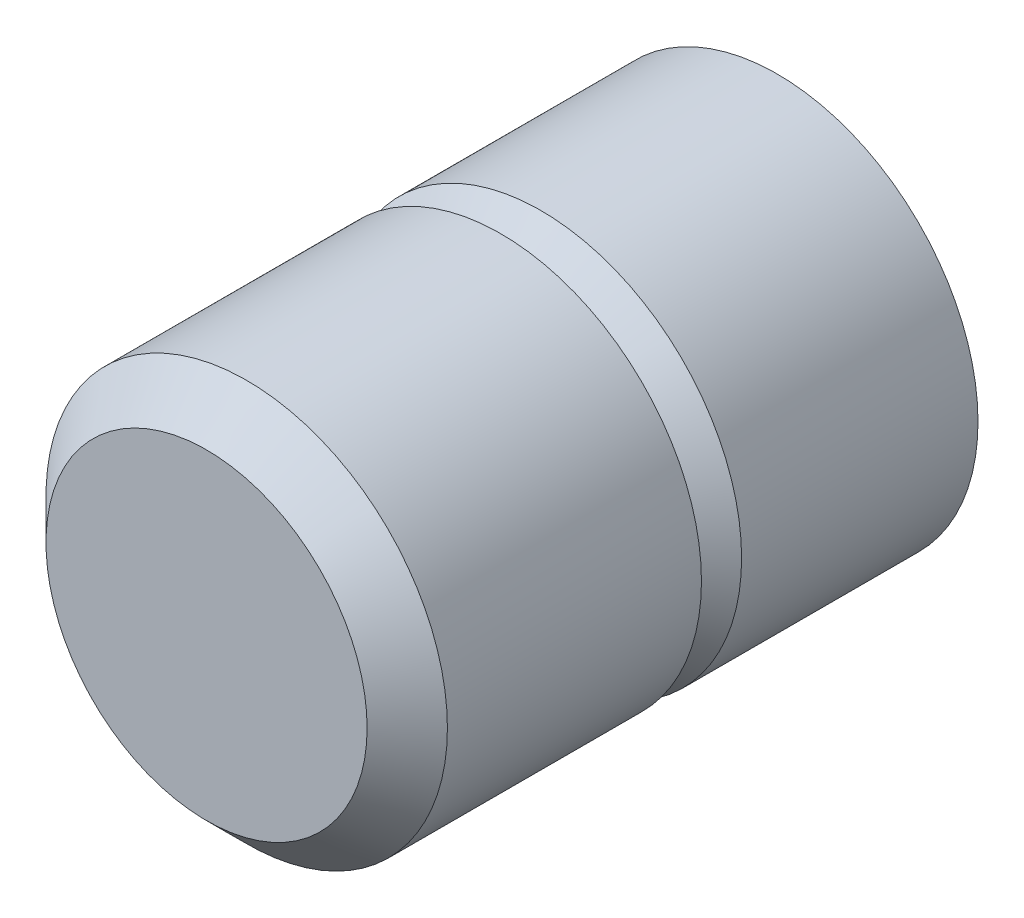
ISO-10303-21;
HEADER;
FILE_DESCRIPTION(('STEP AP214'),'2;1');
FILE_NAME('part.step','',(''),(''),'','','');
FILE_SCHEMA(('AUTOMOTIVE_DESIGN { 1 0 10303 214 1 1 1 1 }'));
ENDSEC;
DATA;
#1=APPLICATION_CONTEXT('core data for automotive mechanical design processes');
#2=APPLICATION_PROTOCOL_DEFINITION('international standard','automotive_design',2000,#1);
#3=PRODUCT_CONTEXT('',#1,'mechanical');
#4=PRODUCT('Part','Part','',(#3));
#5=PRODUCT_RELATED_PRODUCT_CATEGORY('part','',(#4));
#6=PRODUCT_DEFINITION_FORMATION('','',#4);
#7=PRODUCT_DEFINITION_CONTEXT('part definition',#1,'design');
#8=PRODUCT_DEFINITION('design','',#6,#7);
#9=PRODUCT_DEFINITION_SHAPE('','',#8);
#10=(LENGTH_UNIT() NAMED_UNIT(*) SI_UNIT(.MILLI.,.METRE.));
#11=(NAMED_UNIT(*) PLANE_ANGLE_UNIT() SI_UNIT($,.RADIAN.));
#12=(NAMED_UNIT(*) SI_UNIT($,.STERADIAN.) SOLID_ANGLE_UNIT());
#13=UNCERTAINTY_MEASURE_WITH_UNIT(LENGTH_MEASURE(1.E-05),#10,'distance_accuracy_value','');
#14=(GEOMETRIC_REPRESENTATION_CONTEXT(3) GLOBAL_UNCERTAINTY_ASSIGNED_CONTEXT((#13)) GLOBAL_UNIT_ASSIGNED_CONTEXT((#10,
#11,#12)) REPRESENTATION_CONTEXT('',''));
#15=CARTESIAN_POINT('',(0.,0.,0.));
#16=DIRECTION('',(0.,0.,1.));
#17=DIRECTION('',(1.,0.,0.));
#18=AXIS2_PLACEMENT_3D('',#15,#16,#17);
#19=CARTESIAN_POINT('',(0.,0.,0.));
#20=DIRECTION('',(0.,0.,-1.));
#21=DIRECTION('',(-1.,0.,0.));
#22=AXIS2_PLACEMENT_3D('',#19,#20,#21);
#23=PLANE('',#22);
#24=CARTESIAN_POINT('',(0.,0.,0.));
#25=DIRECTION('',(0.,0.,1.));
#26=DIRECTION('',(1.,0.,0.));
#27=AXIS2_PLACEMENT_3D('',#24,#25,#26);
#28=CIRCLE('',#27,6.002528);
#29=CARTESIAN_POINT('',(6.002528,0.,0.));
#30=VERTEX_POINT('',#29);
#31=EDGE_CURVE('E10',#30,#30,#28,.T.);
#32=ORIENTED_EDGE('',*,*,#31,.T.);
#33=EDGE_LOOP('',(#32));
#34=FACE_BOUND('',#33,.T.);
#35=ADVANCED_FACE('F29',(#34),#23,.F.);
#36=CARTESIAN_POINT('',(0.,0.,-1.500632));
#37=DIRECTION('',(0.,0.,-1.));
#38=DIRECTION('',(-1.,0.,0.));
#39=AXIS2_PLACEMENT_3D('',#36,#37,#38);
#40=CONICAL_SURFACE('',#39,7.50316,0.785398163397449);
#41=ORIENTED_EDGE('',*,*,#31,.F.);
#42=EDGE_LOOP('',(#41));
#43=FACE_BOUND('',#42,.T.);
#44=CARTESIAN_POINT('',(0.,0.,-1.500632));
#45=DIRECTION('',(0.,0.,1.));
#46=DIRECTION('',(1.,0.,0.));
#47=AXIS2_PLACEMENT_3D('',#44,#45,#46);
#48=CIRCLE('',#47,7.50316);
#49=CARTESIAN_POINT('',(7.50316,0.,-1.500632));
#50=VERTEX_POINT('',#49);
#51=EDGE_CURVE('E35',#50,#50,#48,.T.);
#52=ORIENTED_EDGE('',*,*,#51,.T.);
#53=EDGE_LOOP('',(#52));
#54=FACE_BOUND('',#53,.T.);
#55=ADVANCED_FACE('F67',(#43,#54),#40,.T.);
#56=CARTESIAN_POINT('',(0.,0.,0.));
#57=DIRECTION('',(0.,0.,1.));
#58=DIRECTION('',(1.,0.,0.));
#59=AXIS2_PLACEMENT_3D('',#56,#57,#58);
#60=CYLINDRICAL_SURFACE('',#59,7.50316);
#61=ORIENTED_EDGE('',*,*,#51,.F.);
#62=EDGE_LOOP('',(#61));
#63=FACE_BOUND('',#62,.T.);
#64=CARTESIAN_POINT('',(0.,0.,-10.9982));
#65=DIRECTION('',(0.,0.,1.));
#66=DIRECTION('',(1.,0.,0.));
#67=AXIS2_PLACEMENT_3D('',#64,#65,#66);
#68=CIRCLE('',#67,7.50316);
#69=CARTESIAN_POINT('',(7.50316,0.,-10.9982));
#70=VERTEX_POINT('',#69);
#71=EDGE_CURVE('E39',#70,#70,#68,.T.);
#72=ORIENTED_EDGE('',*,*,#71,.T.);
#73=EDGE_LOOP('',(#72));
#74=FACE_BOUND('',#73,.T.);
#75=ADVANCED_FACE('F71',(#63,#74),#60,.T.);
#76=CARTESIAN_POINT('',(0.,7.50316,-10.9982));
#77=DIRECTION('',(0.,0.,1.));
#78=DIRECTION('',(1.,0.,0.));
#79=AXIS2_PLACEMENT_3D('',#76,#77,#78);
#80=PLANE('',#79);
#81=ORIENTED_EDGE('',*,*,#71,.F.);
#82=EDGE_LOOP('',(#81));
#83=FACE_BOUND('',#82,.T.);
#84=CARTESIAN_POINT('',(0.,0.,-10.9982));
#85=DIRECTION('',(0.,0.,1.));
#86=DIRECTION('',(1.,0.,0.));
#87=AXIS2_PLACEMENT_3D('',#84,#85,#86);
#88=CIRCLE('',#87,6.002528);
#89=CARTESIAN_POINT('',(6.002528,0.,-10.9982));
#90=VERTEX_POINT('',#89);
#91=EDGE_CURVE('E43',#90,#90,#88,.T.);
#92=ORIENTED_EDGE('',*,*,#91,.T.);
#93=EDGE_LOOP('',(#92));
#94=FACE_BOUND('',#93,.T.);
#95=ADVANCED_FACE('F76',(#83,#94),#80,.F.);
#96=CARTESIAN_POINT('',(0.,0.,-12.498832));
#97=DIRECTION('',(0.,0.,-1.));
#98=DIRECTION('',(-1.,0.,0.));
#99=AXIS2_PLACEMENT_3D('',#96,#97,#98);
#100=CONICAL_SURFACE('',#99,7.50316,0.785398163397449);
#101=ORIENTED_EDGE('',*,*,#91,.F.);
#102=EDGE_LOOP('',(#101));
#103=FACE_BOUND('',#102,.T.);
#104=CARTESIAN_POINT('',(0.,0.,-12.498832));
#105=DIRECTION('',(0.,0.,1.));
#106=DIRECTION('',(1.,0.,0.));
#107=AXIS2_PLACEMENT_3D('',#104,#105,#106);
#108=CIRCLE('',#107,7.50316);
#109=CARTESIAN_POINT('',(7.50316,0.,-12.498832));
#110=VERTEX_POINT('',#109);
#111=EDGE_CURVE('E48',#110,#110,#108,.T.);
#112=ORIENTED_EDGE('',*,*,#111,.T.);
#113=EDGE_LOOP('',(#112));
#114=FACE_BOUND('',#113,.T.);
#115=ADVANCED_FACE('F63',(#103,#114),#100,.T.);
#116=CARTESIAN_POINT('',(0.,0.,0.));
#117=DIRECTION('',(0.,0.,1.));
#118=DIRECTION('',(1.,0.,0.));
#119=AXIS2_PLACEMENT_3D('',#116,#117,#118);
#120=CYLINDRICAL_SURFACE('',#119,7.50316);
#121=ORIENTED_EDGE('',*,*,#111,.F.);
#122=EDGE_LOOP('',(#121));
#123=FACE_BOUND('',#122,.T.);
#124=CARTESIAN_POINT('',(0.,0.,-21.336));
#125=DIRECTION('',(0.,0.,1.));
#126=DIRECTION('',(1.,0.,0.));
#127=AXIS2_PLACEMENT_3D('',#124,#125,#126);
#128=CIRCLE('',#127,7.50316);
#129=CARTESIAN_POINT('',(7.50316,0.,-21.336));
#130=VERTEX_POINT('',#129);
#131=EDGE_CURVE('E51',#130,#130,#128,.T.);
#132=ORIENTED_EDGE('',*,*,#131,.T.);
#133=EDGE_LOOP('',(#132));
#134=FACE_BOUND('',#133,.T.);
#135=ADVANCED_FACE('F55',(#123,#134),#120,.T.);
#136=CARTESIAN_POINT('',(0.,7.50316,-21.336));
#137=DIRECTION('',(0.,0.,1.));
#138=DIRECTION('',(1.,0.,0.));
#139=AXIS2_PLACEMENT_3D('',#136,#137,#138);
#140=PLANE('',#139);
#141=ORIENTED_EDGE('',*,*,#131,.F.);
#142=EDGE_LOOP('',(#141));
#143=FACE_BOUND('',#142,.T.);
#144=ADVANCED_FACE('F57',(#143),#140,.F.);
#145=CLOSED_SHELL('',(#35,#55,#75,#95,#115,#135,#144));
#146=MANIFOLD_SOLID_BREP('B2',#145);
#147=ADVANCED_BREP_SHAPE_REPRESENTATION('',(#18,#146),#14);
#148=SHAPE_DEFINITION_REPRESENTATION(#9,#147);
ENDSEC;
END-ISO-10303-21;
